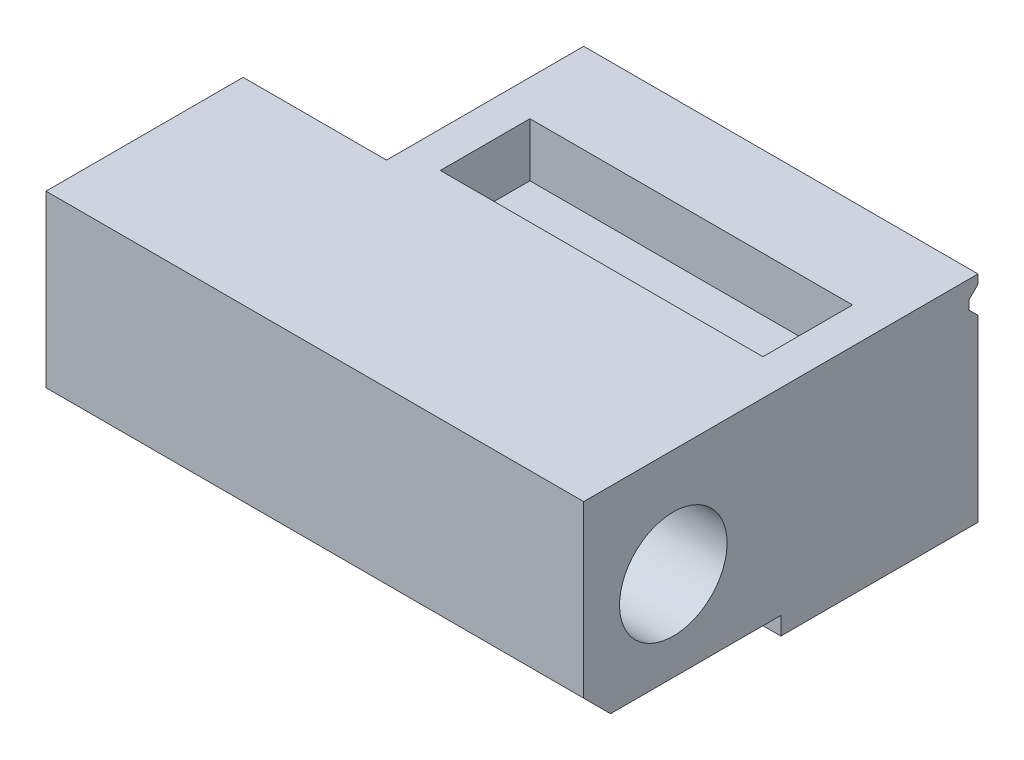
from build123d import *

# Parameters (mm, degrees)
ESQUISSE1_W             = 220
ESQUISSE1_H             = 120
EXTRUSION1_DEPTH        = 110
ESQUISSE2_W             = 300
ESQUISSE2_H             = 110
EXTRUSION2_DEPTH        = 110
ENL_V_MAT_EXTRU_1_DEPTH = 80
ESQUISSE4_W             = 180
ESQUISSE4_H             = 50
ENL_V_MAT_EXTRU_2_DEPTH = 30
ESQUISSE5_W             = 180
ESQUISSE5_H             = 50
ENL_V_MAT_EXTRU_3_DEPTH = 30
CHANFREIN1_SIZE         = 15
ESQUISSE6_R             = 30
ENL_V_MAT_EXTRU_4_DEPTH = 377.828873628
ENL_V_MAT_EXTRU_5_DEPTH = 377.828873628


with BuildPart() as part:
    # Esquisse1 → Extrusion1 (new body)
    with BuildSketch(Plane.XY):
        with Locations((-110, 0)):
            Rectangle(ESQUISSE1_W, ESQUISSE1_H)
    extrude(amount=EXTRUSION1_DEPTH)

    # Esquisse2 → Extrusion2 (add)
    with BuildSketch(Plane.XY.offset(110)):
        with Locations((-150, 5)):
            Rectangle(ESQUISSE2_W, ESQUISSE2_H)
    extrude(amount=EXTRUSION2_DEPTH)

    # Esquisse3 → Enl_v. mat.-Extru.1 (cut)
    with BuildSketch(Plane.ZY.offset(300)):
        Polygon((110, 5), (130, -50), (110, -50), align=None)
    extrude(amount=-ENL_V_MAT_EXTRU_1_DEPTH, mode=Mode.SUBTRACT)

    # Esquisse4 → Enl_v. mat.-Extru.2 (cut)
    with BuildSketch(Plane.XZ.offset(60)):
        with Locations((-110, 75)):
            Rectangle(ESQUISSE4_W, ESQUISSE4_H)
    extrude(amount=-ENL_V_MAT_EXTRU_2_DEPTH, mode=Mode.SUBTRACT)

    # Esquisse5 → Enl_v. mat.-Extru.3 (cut)
    with BuildSketch(Plane(origin=(0, 60, 0), x_dir=(-1, 0, 0), z_dir=(0, 1, 0))):
        with Locations((110, 75)):
            Rectangle(ESQUISSE5_W, ESQUISSE5_H)
    extrude(amount=-ENL_V_MAT_EXTRU_3_DEPTH, mode=Mode.SUBTRACT)

    # Chanfrein1
    chanfrein1_edges = [part.edges().sort_by_distance(p)[0] for p in [
        (-150, -50, 220),
    ]]
    chamfer(chanfrein1_edges, length=CHANFREIN1_SIZE)

    # Esquisse6 → Enl_v. mat.-Extru.4 (cut, through all)
    with BuildSketch(Plane(origin=(0, 0, 0), x_dir=(0, 0, -1), z_dir=(1, 0, 0))):
        with Locations(Location((-170, 0, 0), (0, 0, 90))):
            Circle(ESQUISSE6_R)
    extrude(amount=-ENL_V_MAT_EXTRU_4_DEPTH, mode=Mode.SUBTRACT)

    # Esquisse7 → Enl_v. mat.-Extru.5 (cut, through all)
    with BuildSketch(Plane(origin=(0, 0, 0), x_dir=(0, 0, -1), z_dir=(1, 0, 0))):
        Polygon((0, 55), (-5, 50), (-5, 45), (0, 40), (0, -40), (8.431351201, -40), (8.431351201, 55), align=None)
    extrude(amount=-ENL_V_MAT_EXTRU_5_DEPTH, mode=Mode.SUBTRACT)


solid = part.part
